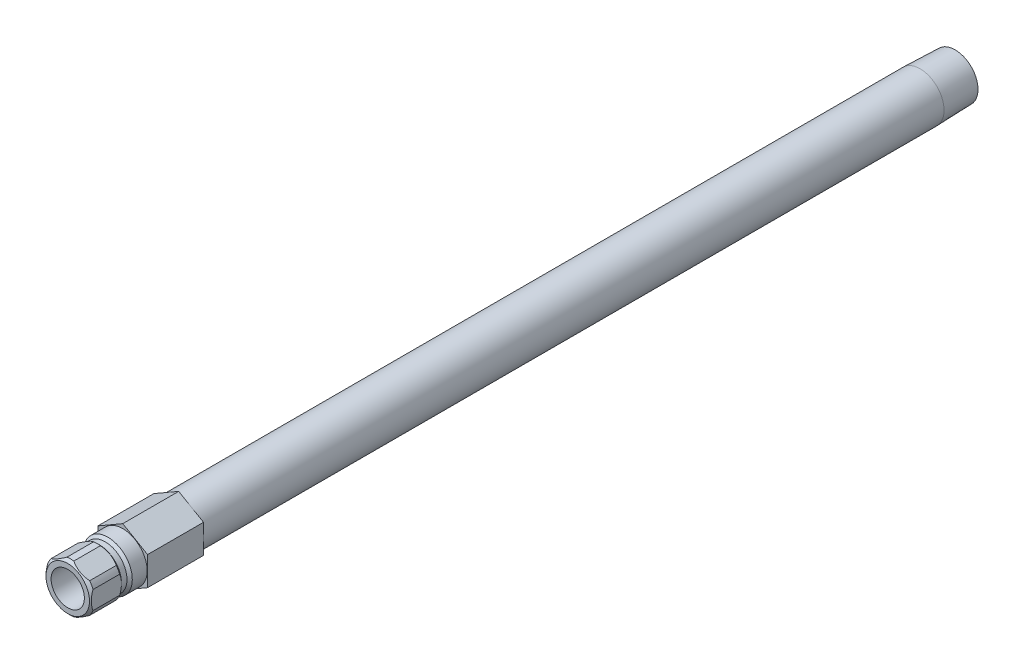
from build123d import *

# Parameters (mm, degrees)
SKETCH2_R           = 4.6228
BOSS_EXTRUDE1_DEPTH = 16.002
CUT_EXTRUDE1_START  = 6.604
SKETCH3_OUTSIDE_W   = 67.21
SKETCH3_OUTSIDE_H   = 69.41
CUT_EXTRUDE1_DEPTH  = 232.895552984


with BuildPart() as part:
    # Sketch1 → Revolve1 (revolve)
    with BuildSketch(Plane(origin=(0, 0, 0), x_dir=(0, 0, -1), z_dir=(1, 0, 0))):
        Polygon((-15.748, 4.7625), (-15.748, 6.223), (-14.986, 6.985), (-7.366, 6.985), (-6.604, 6.223), (-5.0165, 6.223), (-4.2545, 6.985), (0, 6.985), (0, 6.858), (228.219, 6.858), (238.252, 6.544470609), (238.252, 4.6228), (-3.481720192, 4.6228), (-3.556, 4.7625), align=None)
    revolve(axis=Axis((0, 0, 12.87483316), (0, 0, 1)))

    # Sketch2 → Boss-Extrude1 (add)
    with BuildSketch(Plane.XY):
        Polygon((-7.112, 4.106115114), (-7.112, -4.106115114), (0, -8.212230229), (7.112, -4.106115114), (7.112, 4.106115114), (0, 8.212230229), align=None)
        with Locations(Location((0, 0, 0), (0, 0, 90))):
            Circle(SKETCH2_R, mode=Mode.SUBTRACT)
    extrude(amount=-BOSS_EXTRUDE1_DEPTH)

    # Sketch3 outside → Cut-Extrude1 (cut, through all)
    with BuildSketch(Plane.XY.offset(CUT_EXTRUDE1_START)):
        Rectangle(SKETCH3_OUTSIDE_W, SKETCH3_OUTSIDE_H)
        Polygon((6.477, -3.739497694), (6.477, 3.739497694), (0, 7.478995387), (-6.477, 3.739497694), (-6.477, -3.739497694), (0, -7.478995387), align=None, mode=Mode.SUBTRACT)
    extrude(amount=CUT_EXTRUDE1_DEPTH, mode=Mode.SUBTRACT)


solid = part.part
